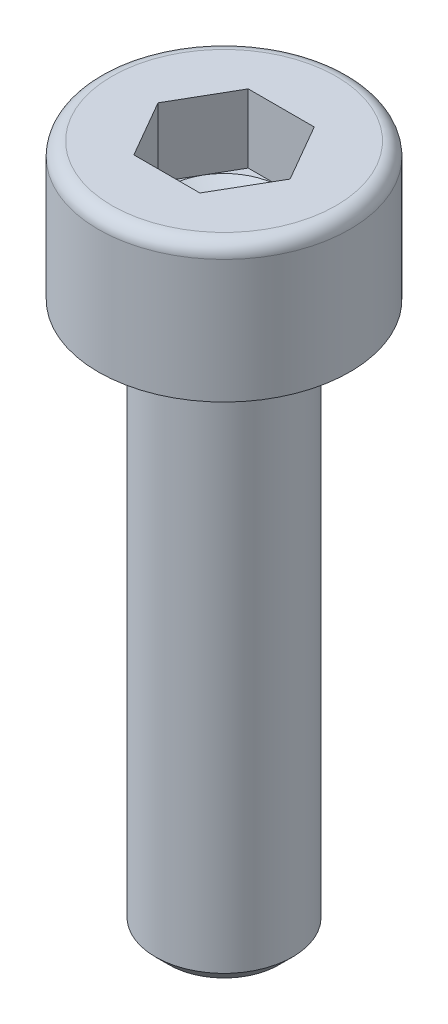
ISO-10303-21;
HEADER;
FILE_DESCRIPTION(('STEP AP214'),'2;1');
FILE_NAME('part.step','',(''),(''),'','','');
FILE_SCHEMA(('AUTOMOTIVE_DESIGN { 1 0 10303 214 1 1 1 1 }'));
ENDSEC;
DATA;
#1=APPLICATION_CONTEXT('core data for automotive mechanical design processes');
#2=APPLICATION_PROTOCOL_DEFINITION('international standard','automotive_design',2000,#1);
#3=PRODUCT_CONTEXT('',#1,'mechanical');
#4=PRODUCT('Part','Part','',(#3));
#5=PRODUCT_RELATED_PRODUCT_CATEGORY('part','',(#4));
#6=PRODUCT_DEFINITION_FORMATION('','',#4);
#7=PRODUCT_DEFINITION_CONTEXT('part definition',#1,'design');
#8=PRODUCT_DEFINITION('design','',#6,#7);
#9=PRODUCT_DEFINITION_SHAPE('','',#8);
#10=(LENGTH_UNIT() NAMED_UNIT(*) SI_UNIT(.MILLI.,.METRE.));
#11=(NAMED_UNIT(*) PLANE_ANGLE_UNIT() SI_UNIT($,.RADIAN.));
#12=(NAMED_UNIT(*) SI_UNIT($,.STERADIAN.) SOLID_ANGLE_UNIT());
#13=UNCERTAINTY_MEASURE_WITH_UNIT(LENGTH_MEASURE(1.E-05),#10,'distance_accuracy_value','');
#14=(GEOMETRIC_REPRESENTATION_CONTEXT(3) GLOBAL_UNCERTAINTY_ASSIGNED_CONTEXT((#13)) GLOBAL_UNIT_ASSIGNED_CONTEXT((#10,
#11,#12)) REPRESENTATION_CONTEXT('',''));
#15=CARTESIAN_POINT('',(0.,0.,0.));
#16=DIRECTION('',(0.,0.,1.));
#17=DIRECTION('',(1.,0.,0.));
#18=AXIS2_PLACEMENT_3D('',#15,#16,#17);
#19=CARTESIAN_POINT('',(0.,-12.,0.));
#20=DIRECTION('',(0.,1.,0.));
#21=DIRECTION('',(0.,0.,1.));
#22=AXIS2_PLACEMENT_3D('',#19,#20,#21);
#23=CYLINDRICAL_SURFACE('',#22,1.5);
#24=CARTESIAN_POINT('',(0.,-11.7,0.));
#25=DIRECTION('',(0.,1.,0.));
#26=DIRECTION('',(0.,0.,1.));
#27=AXIS2_PLACEMENT_3D('',#24,#25,#26);
#28=CIRCLE('',#27,1.5);
#29=CARTESIAN_POINT('',(0.,-11.7,1.5));
#30=VERTEX_POINT('',#29);
#31=EDGE_CURVE('E36',#30,#30,#28,.T.);
#32=ORIENTED_EDGE('',*,*,#31,.T.);
#33=EDGE_LOOP('',(#32));
#34=FACE_BOUND('',#33,.T.);
#35=CARTESIAN_POINT('',(0.,0.,0.));
#36=DIRECTION('',(0.,1.,0.));
#37=DIRECTION('',(0.,0.,1.));
#38=AXIS2_PLACEMENT_3D('',#35,#36,#37);
#39=CIRCLE('',#38,1.5);
#40=CARTESIAN_POINT('',(0.,0.,1.5));
#41=VERTEX_POINT('',#40);
#42=EDGE_CURVE('E147',#41,#41,#39,.T.);
#43=ORIENTED_EDGE('',*,*,#42,.F.);
#44=EDGE_LOOP('',(#43));
#45=FACE_BOUND('',#44,.T.);
#46=ADVANCED_FACE('F29',(#34,#45),#23,.T.);
#47=CARTESIAN_POINT('',(0.,-12.,0.));
#48=DIRECTION('',(0.,1.,0.));
#49=DIRECTION('',(0.,0.,1.));
#50=AXIS2_PLACEMENT_3D('',#47,#48,#49);
#51=PLANE('',#50);
#52=CARTESIAN_POINT('',(0.,-12.,0.));
#53=DIRECTION('',(0.,1.,0.));
#54=DIRECTION('',(0.,0.,1.));
#55=AXIS2_PLACEMENT_3D('',#52,#53,#54);
#56=CIRCLE('',#55,1.2);
#57=CARTESIAN_POINT('',(0.,-12.,1.2));
#58=VERTEX_POINT('',#57);
#59=EDGE_CURVE('E11',#58,#58,#56,.F.);
#60=ORIENTED_EDGE('',*,*,#59,.T.);
#61=EDGE_LOOP('',(#60));
#62=FACE_BOUND('',#61,.T.);
#63=ADVANCED_FACE('F157',(#62),#51,.F.);
#64=CARTESIAN_POINT('',(0.,-11.7,0.));
#65=DIRECTION('',(0.,1.,0.));
#66=DIRECTION('',(0.,0.,1.));
#67=AXIS2_PLACEMENT_3D('',#64,#65,#66);
#68=CONICAL_SURFACE('',#67,1.5,0.785398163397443);
#69=CARTESIAN_POINT('',(0.,-12.,1.2));
#70=CARTESIAN_POINT('',(0.,-11.996875,1.203125));
#71=CARTESIAN_POINT('',(0.,-11.99375,1.20625));
#72=CARTESIAN_POINT('',(0.,-11.9875,1.2125));
#73=CARTESIAN_POINT('',(0.,-11.984375,1.215625));
#74=CARTESIAN_POINT('',(0.,-11.978125,1.221875));
#75=CARTESIAN_POINT('',(0.,-11.975,1.225));
#76=CARTESIAN_POINT('',(0.,-11.96875,1.23125));
#77=CARTESIAN_POINT('',(0.,-11.965625,1.234375));
#78=CARTESIAN_POINT('',(0.,-11.959375,1.240625));
#79=CARTESIAN_POINT('',(0.,-11.95625,1.24375));
#80=CARTESIAN_POINT('',(0.,-11.95,1.25));
#81=CARTESIAN_POINT('',(0.,-11.946875,1.253125));
#82=CARTESIAN_POINT('',(0.,-11.940625,1.259375));
#83=CARTESIAN_POINT('',(0.,-11.9375,1.2625));
#84=CARTESIAN_POINT('',(0.,-11.93125,1.26875));
#85=CARTESIAN_POINT('',(0.,-11.928125,1.271875));
#86=CARTESIAN_POINT('',(0.,-11.921875,1.278125));
#87=CARTESIAN_POINT('',(0.,-11.91875,1.28125));
#88=CARTESIAN_POINT('',(0.,-11.9125,1.2875));
#89=CARTESIAN_POINT('',(0.,-11.909375,1.290625));
#90=CARTESIAN_POINT('',(0.,-11.903125,1.296875));
#91=CARTESIAN_POINT('',(0.,-11.9,1.3));
#92=CARTESIAN_POINT('',(0.,-11.89375,1.30625));
#93=CARTESIAN_POINT('',(0.,-11.890625,1.309375));
#94=CARTESIAN_POINT('',(0.,-11.884375,1.315625));
#95=CARTESIAN_POINT('',(0.,-11.88125,1.31875));
#96=CARTESIAN_POINT('',(0.,-11.875,1.325));
#97=CARTESIAN_POINT('',(0.,-11.871875,1.328125));
#98=CARTESIAN_POINT('',(0.,-11.865625,1.334375));
#99=CARTESIAN_POINT('',(0.,-11.8625,1.3375));
#100=CARTESIAN_POINT('',(0.,-11.85625,1.34375));
#101=CARTESIAN_POINT('',(0.,-11.853125,1.346875));
#102=CARTESIAN_POINT('',(0.,-11.846875,1.353125));
#103=CARTESIAN_POINT('',(0.,-11.84375,1.35625));
#104=CARTESIAN_POINT('',(0.,-11.8375,1.3625));
#105=CARTESIAN_POINT('',(0.,-11.834375,1.365625));
#106=CARTESIAN_POINT('',(0.,-11.828125,1.371875));
#107=CARTESIAN_POINT('',(0.,-11.825,1.375));
#108=CARTESIAN_POINT('',(0.,-11.81875,1.38125));
#109=CARTESIAN_POINT('',(0.,-11.815625,1.384375));
#110=CARTESIAN_POINT('',(0.,-11.809375,1.390625));
#111=CARTESIAN_POINT('',(0.,-11.80625,1.39375));
#112=CARTESIAN_POINT('',(0.,-11.8,1.4));
#113=CARTESIAN_POINT('',(0.,-11.796875,1.403125));
#114=CARTESIAN_POINT('',(0.,-11.790625,1.409375));
#115=CARTESIAN_POINT('',(0.,-11.7875,1.4125));
#116=CARTESIAN_POINT('',(0.,-11.78125,1.41875));
#117=CARTESIAN_POINT('',(0.,-11.778125,1.421875));
#118=CARTESIAN_POINT('',(0.,-11.771875,1.428125));
#119=CARTESIAN_POINT('',(0.,-11.76875,1.43125));
#120=CARTESIAN_POINT('',(0.,-11.7625,1.4375));
#121=CARTESIAN_POINT('',(0.,-11.759375,1.440625));
#122=CARTESIAN_POINT('',(0.,-11.753125,1.446875));
#123=CARTESIAN_POINT('',(0.,-11.75,1.45));
#124=CARTESIAN_POINT('',(0.,-11.74375,1.45625));
#125=CARTESIAN_POINT('',(0.,-11.740625,1.459375));
#126=CARTESIAN_POINT('',(0.,-11.734375,1.465625));
#127=CARTESIAN_POINT('',(0.,-11.73125,1.46875));
#128=CARTESIAN_POINT('',(0.,-11.725,1.475));
#129=CARTESIAN_POINT('',(0.,-11.721875,1.478125));
#130=CARTESIAN_POINT('',(0.,-11.715625,1.484375));
#131=CARTESIAN_POINT('',(0.,-11.7125,1.4875));
#132=CARTESIAN_POINT('',(0.,-11.70625,1.49375));
#133=CARTESIAN_POINT('',(0.,-11.703125,1.496875));
#134=CARTESIAN_POINT('',(0.,-11.7,1.5));
#135=B_SPLINE_CURVE_WITH_KNOTS('',3,(#69,#70,#71,#72,#73,#74,#75,#76,#77,#78,#79,#80,#81,#82,
#83,#84,#85,#86,#87,#88,#89,#90,#91,#92,#93,#94,#95,#96,#97,#98,#99,#100,#101,#102,#103,#104,
#105,#106,#107,#108,#109,#110,#111,#112,#113,#114,#115,#116,#117,#118,#119,#120,#121,#122,#123,
#124,#125,#126,#127,#128,#129,#130,#131,#132,#133,#134),.UNSPECIFIED.,.F.,.F.,(4,2,2,2,2,2,2,2,
2,2,2,2,2,2,2,2,2,2,2,2,2,2,2,2,2,2,2,2,2,2,2,2,4),(0.,0.0132582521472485,0.0265165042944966,
0.0397747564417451,0.0530330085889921,0.0662912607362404,0.0795495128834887,0.0928077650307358,
0.106066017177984,0.119324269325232,0.132582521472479,0.145840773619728,0.159099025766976,
0.172357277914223,0.185615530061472,0.19887378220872,0.212132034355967,0.225390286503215,
0.238648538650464,0.251906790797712,0.265165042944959,0.278423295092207,0.291681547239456,
0.304939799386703,0.318198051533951,0.331456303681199,0.344714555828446,0.357972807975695,
0.371231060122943,0.38448931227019,0.397747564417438,0.411005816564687,0.424264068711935),.UNSPECIFIED.);
#136=EDGE_CURVE('BSEAM154',#58,#30,#135,.T.);
#137=ORIENTED_EDGE('',*,*,#59,.F.);
#138=ORIENTED_EDGE('',*,*,#31,.F.);
#139=ORIENTED_EDGE('',*,*,#136,.T.);
#140=ORIENTED_EDGE('',*,*,#136,.F.);
#141=EDGE_LOOP('',(#137,#139,#138,#140));
#142=FACE_BOUND('',#141,.T.);
#143=ADVANCED_FACE('F154',(#142),#68,.T.);
#144=CARTESIAN_POINT('',(0.,0.,0.));
#145=DIRECTION('',(0.,1.,0.));
#146=DIRECTION('',(0.,0.,1.));
#147=AXIS2_PLACEMENT_3D('',#144,#145,#146);
#148=PLANE('',#147);
#149=ORIENTED_EDGE('',*,*,#42,.T.);
#150=EDGE_LOOP('',(#149));
#151=FACE_BOUND('',#150,.T.);
#152=CARTESIAN_POINT('',(0.,0.,0.));
#153=DIRECTION('',(0.,1.,0.));
#154=DIRECTION('',(0.,0.,1.));
#155=AXIS2_PLACEMENT_3D('',#152,#153,#154);
#156=CIRCLE('',#155,2.75);
#157=CARTESIAN_POINT('',(0.,0.,2.75));
#158=VERTEX_POINT('',#157);
#159=EDGE_CURVE('E144',#158,#158,#156,.T.);
#160=ORIENTED_EDGE('',*,*,#159,.F.);
#161=EDGE_LOOP('',(#160));
#162=FACE_BOUND('',#161,.T.);
#163=ADVANCED_FACE('F156',(#151,#162),#148,.F.);
#164=CARTESIAN_POINT('',(0.,3.,0.));
#165=DIRECTION('',(0.,1.,0.));
#166=DIRECTION('',(0.,0.,1.));
#167=AXIS2_PLACEMENT_3D('',#164,#165,#166);
#168=CYLINDRICAL_SURFACE('',#167,2.75);
#169=CARTESIAN_POINT('',(0.,2.7,0.));
#170=DIRECTION('',(0.,1.,0.));
#171=DIRECTION('',(0.,0.,1.));
#172=AXIS2_PLACEMENT_3D('',#169,#170,#171);
#173=CIRCLE('',#172,2.75);
#174=CARTESIAN_POINT('',(0.,2.7,2.75));
#175=VERTEX_POINT('',#174);
#176=EDGE_CURVE('E141',#175,#175,#173,.T.);
#177=ORIENTED_EDGE('',*,*,#176,.F.);
#178=EDGE_LOOP('',(#177));
#179=FACE_BOUND('',#178,.T.);
#180=ORIENTED_EDGE('',*,*,#159,.T.);
#181=EDGE_LOOP('',(#180));
#182=FACE_BOUND('',#181,.T.);
#183=ADVANCED_FACE('F164',(#179,#182),#168,.T.);
#184=CARTESIAN_POINT('',(0.,2.7,0.));
#185=DIRECTION('',(0.,1.,0.));
#186=DIRECTION('',(0.,0.,1.));
#187=AXIS2_PLACEMENT_3D('',#184,#185,#186);
#188=TOROIDAL_SURFACE('',#187,2.45,0.3);
#189=CARTESIAN_POINT('',(0.,3.,0.));
#190=DIRECTION('',(0.,1.,0.));
#191=DIRECTION('',(0.,0.,1.));
#192=AXIS2_PLACEMENT_3D('',#189,#190,#191);
#193=CIRCLE('',#192,2.45);
#194=CARTESIAN_POINT('',(0.,3.,2.45));
#195=VERTEX_POINT('',#194);
#196=EDGE_CURVE('E136',#195,#195,#193,.T.);
#197=ORIENTED_EDGE('',*,*,#196,.F.);
#198=EDGE_LOOP('',(#197));
#199=FACE_BOUND('',#198,.T.);
#200=ORIENTED_EDGE('',*,*,#176,.T.);
#201=EDGE_LOOP('',(#200));
#202=FACE_BOUND('',#201,.T.);
#203=ADVANCED_FACE('F195',(#199,#202),#188,.T.);
#204=CARTESIAN_POINT('',(1.25,3.,0.));
#205=DIRECTION('',(0.,-1.,0.));
#206=DIRECTION('',(0.,0.,-1.));
#207=AXIS2_PLACEMENT_3D('',#204,#205,#206);
#208=PLANE('',#207);
#209=DIRECTION('',(-1.,0.,0.));
#210=VECTOR('',#209,1.);
#211=CARTESIAN_POINT('',(-0.721687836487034,3.,-1.25));
#212=LINE('',#211,#210);
#213=CARTESIAN_POINT('',(0.721687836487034,3.,-1.25));
#214=VERTEX_POINT('',#213);
#215=CARTESIAN_POINT('',(-0.721687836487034,3.,-1.25));
#216=VERTEX_POINT('',#215);
#217=EDGE_CURVE('E43',#214,#216,#212,.T.);
#218=ORIENTED_EDGE('',*,*,#217,.F.);
#219=DIRECTION('',(-0.499999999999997,0.,-0.86602540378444));
#220=VECTOR('',#219,1.);
#221=CARTESIAN_POINT('',(0.721687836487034,3.,-1.25));
#222=LINE('',#221,#220);
#223=CARTESIAN_POINT('',(1.44337567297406,3.,0.));
#224=VERTEX_POINT('',#223);
#225=EDGE_CURVE('E120',#224,#214,#222,.T.);
#226=ORIENTED_EDGE('',*,*,#225,.F.);
#227=DIRECTION('',(0.499999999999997,0.,-0.86602540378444));
#228=VECTOR('',#227,1.);
#229=CARTESIAN_POINT('',(0.721687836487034,3.,1.25));
#230=LINE('',#229,#228);
#231=CARTESIAN_POINT('',(0.721687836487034,3.,1.25));
#232=VERTEX_POINT('',#231);
#233=EDGE_CURVE('E368',#232,#224,#230,.T.);
#234=ORIENTED_EDGE('',*,*,#233,.F.);
#235=DIRECTION('',(1.,0.,0.));
#236=VECTOR('',#235,1.);
#237=CARTESIAN_POINT('',(-0.721687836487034,3.,1.25));
#238=LINE('',#237,#236);
#239=CARTESIAN_POINT('',(-0.721687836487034,3.,1.25));
#240=VERTEX_POINT('',#239);
#241=EDGE_CURVE('E366',#240,#232,#238,.T.);
#242=ORIENTED_EDGE('',*,*,#241,.F.);
#243=DIRECTION('',(0.499999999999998,0.,0.86602540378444));
#244=VECTOR('',#243,1.);
#245=CARTESIAN_POINT('',(-0.721687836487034,3.,1.25));
#246=LINE('',#245,#244);
#247=CARTESIAN_POINT('',(-1.44337567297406,3.,0.));
#248=VERTEX_POINT('',#247);
#249=EDGE_CURVE('E104',#248,#240,#246,.T.);
#250=ORIENTED_EDGE('',*,*,#249,.F.);
#251=DIRECTION('',(-0.499999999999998,0.,0.86602540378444));
#252=VECTOR('',#251,1.);
#253=CARTESIAN_POINT('',(-0.721687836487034,3.,-1.25));
#254=LINE('',#253,#252);
#255=EDGE_CURVE('E100',#216,#248,#254,.T.);
#256=ORIENTED_EDGE('',*,*,#255,.F.);
#257=EDGE_LOOP('',(#218,#226,#234,#242,#250,#256));
#258=FACE_BOUND('',#257,.T.);
#259=ORIENTED_EDGE('',*,*,#196,.T.);
#260=EDGE_LOOP('',(#259));
#261=FACE_BOUND('',#260,.T.);
#262=ADVANCED_FACE('F101',(#258,#261),#208,.F.);
#263=CARTESIAN_POINT('',(0.721687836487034,1.5,-1.25));
#264=DIRECTION('',(0.86602540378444,0.,-0.499999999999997));
#265=DIRECTION('',(-0.499999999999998,0.,-0.86602540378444));
#266=AXIS2_PLACEMENT_3D('',#263,#264,#265);
#267=PLANE('',#266);
#268=ORIENTED_EDGE('',*,*,#225,.T.);
#269=DIRECTION('',(0.,1.,0.));
#270=VECTOR('',#269,1.);
#271=CARTESIAN_POINT('',(0.721687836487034,1.5,-1.25));
#272=LINE('',#271,#270);
#273=CARTESIAN_POINT('',(0.721687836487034,1.5,-1.25));
#274=VERTEX_POINT('',#273);
#275=EDGE_CURVE('E118',#274,#214,#272,.T.);
#276=ORIENTED_EDGE('',*,*,#275,.F.);
#277=DIRECTION('',(-0.499999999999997,0.,-0.86602540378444));
#278=VECTOR('',#277,1.);
#279=CARTESIAN_POINT('',(0.721687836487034,1.5,-1.25));
#280=LINE('',#279,#278);
#281=CARTESIAN_POINT('',(1.08253175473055,1.5,-0.624999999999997));
#282=VERTEX_POINT('',#281);
#283=EDGE_CURVE('E370',#282,#274,#280,.T.);
#284=ORIENTED_EDGE('',*,*,#283,.F.);
#285=CARTESIAN_POINT('',(1.44337567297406,1.5,0.));
#286=VERTEX_POINT('',#285);
#287=EDGE_CURVE('E374',#286,#282,#280,.T.);
#288=ORIENTED_EDGE('',*,*,#287,.F.);
#289=DIRECTION('',(0.,1.,0.));
#290=VECTOR('',#289,1.);
#291=CARTESIAN_POINT('',(1.44337567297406,1.5,0.));
#292=LINE('',#291,#290);
#293=EDGE_CURVE('E363',#286,#224,#292,.T.);
#294=ORIENTED_EDGE('',*,*,#293,.T.);
#295=EDGE_LOOP('',(#268,#276,#284,#288,#294));
#296=FACE_BOUND('',#295,.T.);
#297=ADVANCED_FACE('F214',(#296),#267,.F.);
#298=CARTESIAN_POINT('',(0.721687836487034,1.5,1.25));
#299=DIRECTION('',(0.86602540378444,0.,0.499999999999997));
#300=DIRECTION('',(0.499999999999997,0.,-0.86602540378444));
#301=AXIS2_PLACEMENT_3D('',#298,#299,#300);
#302=PLANE('',#301);
#303=ORIENTED_EDGE('',*,*,#233,.T.);
#304=ORIENTED_EDGE('',*,*,#293,.F.);
#305=DIRECTION('',(0.499999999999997,0.,-0.86602540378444));
#306=VECTOR('',#305,1.);
#307=CARTESIAN_POINT('',(0.721687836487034,1.5,1.25));
#308=LINE('',#307,#306);
#309=CARTESIAN_POINT('',(1.08253175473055,1.5,0.624999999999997));
#310=VERTEX_POINT('',#309);
#311=EDGE_CURVE('E358',#310,#286,#308,.T.);
#312=ORIENTED_EDGE('',*,*,#311,.F.);
#313=CARTESIAN_POINT('',(0.721687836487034,1.5,1.25));
#314=VERTEX_POINT('',#313);
#315=EDGE_CURVE('E51',#314,#310,#308,.T.);
#316=ORIENTED_EDGE('',*,*,#315,.F.);
#317=DIRECTION('',(0.,1.,0.));
#318=VECTOR('',#317,1.);
#319=CARTESIAN_POINT('',(0.721687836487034,1.5,1.25));
#320=LINE('',#319,#318);
#321=EDGE_CURVE('E352',#314,#232,#320,.T.);
#322=ORIENTED_EDGE('',*,*,#321,.T.);
#323=EDGE_LOOP('',(#303,#304,#312,#316,#322));
#324=FACE_BOUND('',#323,.T.);
#325=ADVANCED_FACE('F224',(#324),#302,.F.);
#326=CARTESIAN_POINT('',(-0.721687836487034,1.5,1.25));
#327=DIRECTION('',(0.,0.,1.));
#328=DIRECTION('',(1.,0.,0.));
#329=AXIS2_PLACEMENT_3D('',#326,#327,#328);
#330=PLANE('',#329);
#331=ORIENTED_EDGE('',*,*,#241,.T.);
#332=ORIENTED_EDGE('',*,*,#321,.F.);
#333=DIRECTION('',(1.,0.,0.));
#334=VECTOR('',#333,1.);
#335=CARTESIAN_POINT('',(-0.721687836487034,1.5,1.25));
#336=LINE('',#335,#334);
#337=CARTESIAN_POINT('',(0.,1.5,1.25));
#338=VERTEX_POINT('',#337);
#339=EDGE_CURVE('E344',#338,#314,#336,.T.);
#340=ORIENTED_EDGE('',*,*,#339,.F.);
#341=CARTESIAN_POINT('',(-0.721687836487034,1.5,1.25));
#342=VERTEX_POINT('',#341);
#343=EDGE_CURVE('E350',#342,#338,#336,.T.);
#344=ORIENTED_EDGE('',*,*,#343,.F.);
#345=DIRECTION('',(0.,1.,0.));
#346=VECTOR('',#345,1.);
#347=CARTESIAN_POINT('',(-0.721687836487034,1.5,1.25));
#348=LINE('',#347,#346);
#349=EDGE_CURVE('E128',#342,#240,#348,.T.);
#350=ORIENTED_EDGE('',*,*,#349,.T.);
#351=EDGE_LOOP('',(#331,#332,#340,#344,#350));
#352=FACE_BOUND('',#351,.T.);
#353=ADVANCED_FACE('F234',(#352),#330,.F.);
#354=CARTESIAN_POINT('',(-0.721687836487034,1.5,1.25));
#355=DIRECTION('',(-0.86602540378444,0.,0.499999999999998));
#356=DIRECTION('',(0.499999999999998,0.,0.86602540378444));
#357=AXIS2_PLACEMENT_3D('',#354,#355,#356);
#358=PLANE('',#357);
#359=ORIENTED_EDGE('',*,*,#249,.T.);
#360=ORIENTED_EDGE('',*,*,#349,.F.);
#361=DIRECTION('',(0.499999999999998,0.,0.86602540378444));
#362=VECTOR('',#361,1.);
#363=CARTESIAN_POINT('',(-0.721687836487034,1.5,1.25));
#364=LINE('',#363,#362);
#365=CARTESIAN_POINT('',(-1.08253175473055,1.5,0.624999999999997));
#366=VERTEX_POINT('',#365);
#367=EDGE_CURVE('E356',#366,#342,#364,.T.);
#368=ORIENTED_EDGE('',*,*,#367,.F.);
#369=CARTESIAN_POINT('',(-1.44337567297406,1.5,0.));
#370=VERTEX_POINT('',#369);
#371=EDGE_CURVE('E353',#370,#366,#364,.T.);
#372=ORIENTED_EDGE('',*,*,#371,.F.);
#373=DIRECTION('',(0.,1.,0.));
#374=VECTOR('',#373,1.);
#375=CARTESIAN_POINT('',(-1.44337567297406,1.5,0.));
#376=LINE('',#375,#374);
#377=EDGE_CURVE('E126',#370,#248,#376,.T.);
#378=ORIENTED_EDGE('',*,*,#377,.T.);
#379=EDGE_LOOP('',(#359,#360,#368,#372,#378));
#380=FACE_BOUND('',#379,.T.);
#381=ADVANCED_FACE('F244',(#380),#358,.F.);
#382=CARTESIAN_POINT('',(-0.721687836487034,1.5,-1.25));
#383=DIRECTION('',(-0.86602540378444,0.,-0.499999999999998));
#384=DIRECTION('',(-0.499999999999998,0.,0.86602540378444));
#385=AXIS2_PLACEMENT_3D('',#382,#383,#384);
#386=PLANE('',#385);
#387=ORIENTED_EDGE('',*,*,#255,.T.);
#388=ORIENTED_EDGE('',*,*,#377,.F.);
#389=DIRECTION('',(-0.499999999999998,0.,0.86602540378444));
#390=VECTOR('',#389,1.);
#391=CARTESIAN_POINT('',(-0.721687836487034,1.5,-1.25));
#392=LINE('',#391,#390);
#393=CARTESIAN_POINT('',(-1.08253175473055,1.5,-0.624999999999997));
#394=VERTEX_POINT('',#393);
#395=EDGE_CURVE('E380',#394,#370,#392,.T.);
#396=ORIENTED_EDGE('',*,*,#395,.F.);
#397=CARTESIAN_POINT('',(-0.721687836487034,1.5,-1.25));
#398=VERTEX_POINT('',#397);
#399=EDGE_CURVE('E125',#398,#394,#392,.T.);
#400=ORIENTED_EDGE('',*,*,#399,.F.);
#401=DIRECTION('',(0.,1.,0.));
#402=VECTOR('',#401,1.);
#403=CARTESIAN_POINT('',(-0.721687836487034,1.5,-1.25));
#404=LINE('',#403,#402);
#405=EDGE_CURVE('E114',#398,#216,#404,.T.);
#406=ORIENTED_EDGE('',*,*,#405,.T.);
#407=EDGE_LOOP('',(#387,#388,#396,#400,#406));
#408=FACE_BOUND('',#407,.T.);
#409=ADVANCED_FACE('F122',(#408),#386,.F.);
#410=CARTESIAN_POINT('',(-0.721687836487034,1.5,-1.25));
#411=DIRECTION('',(0.,0.,-1.));
#412=DIRECTION('',(-1.,0.,0.));
#413=AXIS2_PLACEMENT_3D('',#410,#411,#412);
#414=PLANE('',#413);
#415=ORIENTED_EDGE('',*,*,#217,.T.);
#416=ORIENTED_EDGE('',*,*,#405,.F.);
#417=DIRECTION('',(-1.,0.,0.));
#418=VECTOR('',#417,1.);
#419=CARTESIAN_POINT('',(-0.721687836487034,1.5,-1.25));
#420=LINE('',#419,#418);
#421=CARTESIAN_POINT('',(0.,1.5,-1.25));
#422=VERTEX_POINT('',#421);
#423=EDGE_CURVE('E377',#422,#398,#420,.T.);
#424=ORIENTED_EDGE('',*,*,#423,.F.);
#425=EDGE_CURVE('E378',#274,#422,#420,.T.);
#426=ORIENTED_EDGE('',*,*,#425,.F.);
#427=ORIENTED_EDGE('',*,*,#275,.T.);
#428=EDGE_LOOP('',(#415,#416,#424,#426,#427));
#429=FACE_BOUND('',#428,.T.);
#430=ADVANCED_FACE('F112',(#429),#414,.F.);
#431=CARTESIAN_POINT('',(0.721687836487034,1.5,-1.25));
#432=DIRECTION('',(0.,1.,0.));
#433=DIRECTION('',(0.,0.,1.));
#434=AXIS2_PLACEMENT_3D('',#431,#432,#433);
#435=PLANE('',#434);
#436=CARTESIAN_POINT('',(0.,1.5,0.));
#437=DIRECTION('',(0.,1.,0.));
#438=DIRECTION('',(0.,0.,1.));
#439=AXIS2_PLACEMENT_3D('',#436,#437,#438);
#440=CIRCLE('',#439,1.25);
#441=EDGE_CURVE('E138',#366,#338,#440,.T.);
#442=ORIENTED_EDGE('',*,*,#441,.F.);
#443=ORIENTED_EDGE('',*,*,#367,.T.);
#444=ORIENTED_EDGE('',*,*,#343,.T.);
#445=EDGE_LOOP('',(#442,#443,#444));
#446=FACE_BOUND('',#445,.T.);
#447=ADVANCED_FACE('F271',(#446),#435,.T.);
#448=EDGE_CURVE('E384',#394,#366,#440,.T.);
#449=ORIENTED_EDGE('',*,*,#448,.F.);
#450=ORIENTED_EDGE('',*,*,#395,.T.);
#451=ORIENTED_EDGE('',*,*,#371,.T.);
#452=EDGE_LOOP('',(#449,#450,#451));
#453=FACE_BOUND('',#452,.T.);
#454=ADVANCED_FACE('F280',(#453),#435,.T.);
#455=EDGE_CURVE('E385',#422,#394,#440,.T.);
#456=ORIENTED_EDGE('',*,*,#455,.F.);
#457=ORIENTED_EDGE('',*,*,#423,.T.);
#458=ORIENTED_EDGE('',*,*,#399,.T.);
#459=EDGE_LOOP('',(#456,#457,#458));
#460=FACE_BOUND('',#459,.T.);
#461=ADVANCED_FACE('F291',(#460),#435,.T.);
#462=EDGE_CURVE('E386',#282,#422,#440,.T.);
#463=ORIENTED_EDGE('',*,*,#462,.F.);
#464=ORIENTED_EDGE('',*,*,#283,.T.);
#465=ORIENTED_EDGE('',*,*,#425,.T.);
#466=EDGE_LOOP('',(#463,#464,#465));
#467=FACE_BOUND('',#466,.T.);
#468=ADVANCED_FACE('F300',(#467),#435,.T.);
#469=EDGE_CURVE('E137',#310,#282,#440,.T.);
#470=ORIENTED_EDGE('',*,*,#469,.F.);
#471=ORIENTED_EDGE('',*,*,#311,.T.);
#472=ORIENTED_EDGE('',*,*,#287,.T.);
#473=EDGE_LOOP('',(#470,#471,#472));
#474=FACE_BOUND('',#473,.T.);
#475=ADVANCED_FACE('F309',(#474),#435,.T.);
#476=EDGE_CURVE('E133',#338,#310,#440,.T.);
#477=ORIENTED_EDGE('',*,*,#476,.F.);
#478=ORIENTED_EDGE('',*,*,#339,.T.);
#479=ORIENTED_EDGE('',*,*,#315,.T.);
#480=EDGE_LOOP('',(#477,#478,#479));
#481=FACE_BOUND('',#480,.T.);
#482=ADVANCED_FACE('F283',(#481),#435,.T.);
#483=CARTESIAN_POINT('',(0.,1.5,0.));
#484=DIRECTION('',(0.,1.,0.));
#485=DIRECTION('',(0.,0.,1.));
#486=AXIS2_PLACEMENT_3D('',#483,#484,#485);
#487=CONICAL_SURFACE('',#486,1.25,1.04719755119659);
#488=CARTESIAN_POINT('',(0.,0.778312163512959,0.));
#489=VERTEX_POINT('',#488);
#490=VERTEX_LOOP('',#489);
#491=FACE_BOUND('',#490,.T.);
#492=ORIENTED_EDGE('',*,*,#476,.T.);
#493=ORIENTED_EDGE('',*,*,#469,.T.);
#494=ORIENTED_EDGE('',*,*,#462,.T.);
#495=ORIENTED_EDGE('',*,*,#455,.T.);
#496=ORIENTED_EDGE('',*,*,#448,.T.);
#497=ORIENTED_EDGE('',*,*,#441,.T.);
#498=EDGE_LOOP('',(#492,#493,#494,#495,#496,#497));
#499=FACE_BOUND('',#498,.T.);
#500=ADVANCED_FACE('F326',(#491,#499),#487,.F.);
#501=CLOSED_SHELL('',(#46,#63,#143,#163,#183,#203,#262,#297,#325,#353,#381,#409,#430,#447,#454,
#461,#468,#475,#482,#500));
#502=MANIFOLD_SOLID_BREP('B2',#501);
#503=ADVANCED_BREP_SHAPE_REPRESENTATION('',(#18,#502),#14);
#504=SHAPE_DEFINITION_REPRESENTATION(#9,#503);
ENDSEC;
END-ISO-10303-21;
